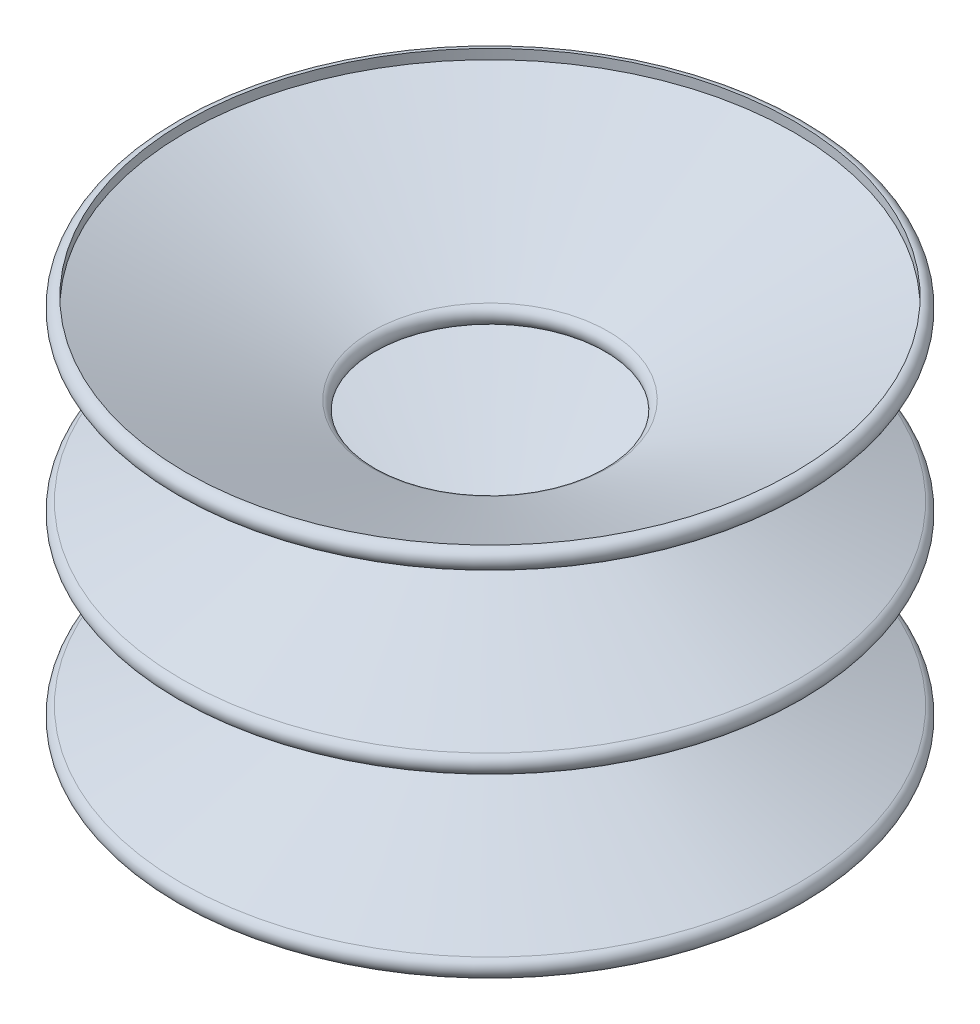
from build123d import *


with BuildPart() as part:
    # Esquisse1 → Base-R_volution (revolve)
    with BuildSketch(Plane.XY, mode=Mode.PRIVATE) as base_r_volution_sk:
        with BuildLine():
            Line((-5, 0), (-10, 0))
            Line((-10, 0), (-10, 4))
            Line((-10, 4), (-31.353311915, 12.06449442))
            ThreePointArc((-31.353311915, 12.06449442), (-31.99977858, 12.978957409), (-31.392361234, 13.91981121))
            Line((-31.392361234, 13.91981121), (-14.607434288, 21.079709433))
            ThreePointArc((-14.607434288, 21.079709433), (-13.999478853, 22), (-14.607434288, 22.920290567))
            Line((-14.607434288, 22.920290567), (-31.392361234, 30.08018879))
            ThreePointArc((-31.392361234, 30.08018879), (-32, 30.999985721), (-31.392387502, 31.919800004))
            Line((-31.392387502, 31.919800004), (-14.607612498, 39.080199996))
            ThreePointArc((-14.607612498, 39.080199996), (-14, 40), (-14.607612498, 40.919800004))
            Line((-14.607612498, 40.919800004), (-31.392387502, 48.080199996))
            ThreePointArc((-31.392387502, 48.080199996), (-31.979744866, 49.200249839), (-31, 50))
            Line((-31, 50), (-31, 49))
            Line((-31, 49), (-12.057638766, 40.91981121))
            ThreePointArc((-12.057638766, 40.91981121), (-11.45, 40), (-12.057638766, 39.08018879))
            Line((-12.057638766, 39.08018879), (-31, 31))
            Line((-31, 31), (-12.057638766, 22.91981121))
            ThreePointArc((-12.057638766, 22.91981121), (-11.45, 22), (-12.057638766, 21.08018879))
            Line((-12.057638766, 21.08018879), (-31, 13))
            Line((-31, 13), (-9, 4.69))
            Line((-9, 4.69), (-9, 1))
            Line((-9, 1), (-5, 1))
            Line((-5, 1), (-5, 0))
        make_face()
    revolve(base_r_volution_sk.sketch.rotate(Axis((0, 90.870985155, 0), (0, -1, 0)), 270), axis=Axis((0, 90.870985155, 0), (0, -1, 0)))


solid = part.part
